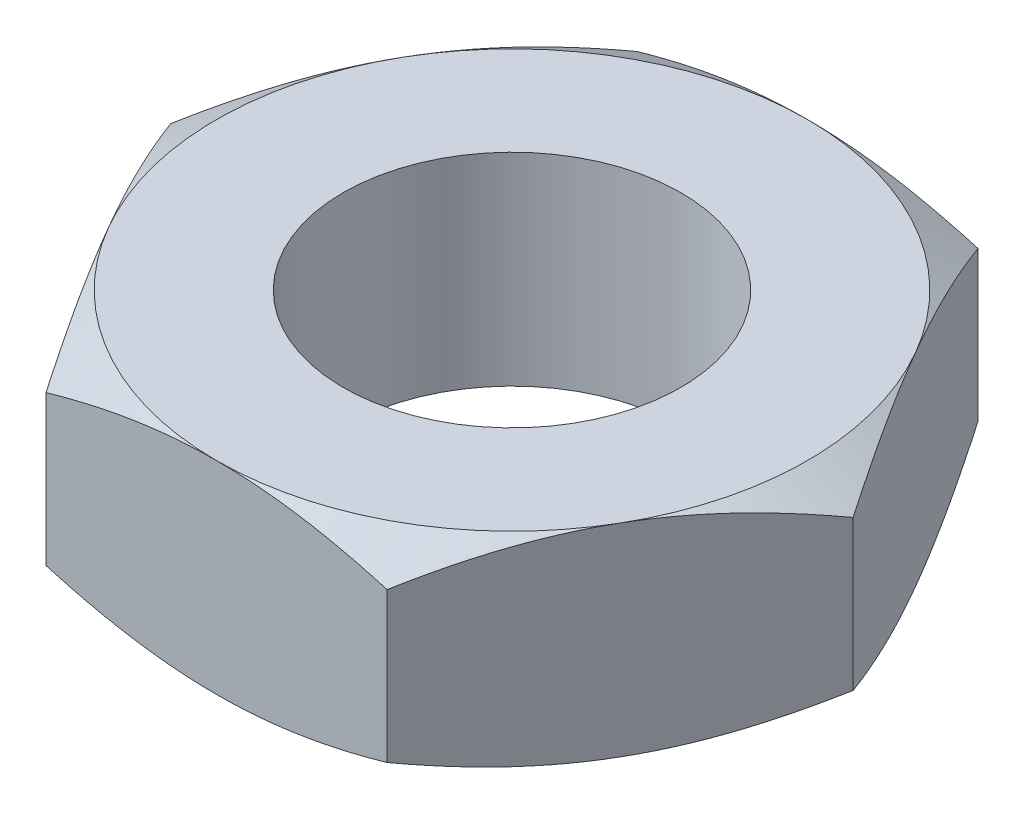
ISO-10303-21;
HEADER;
FILE_DESCRIPTION(('STEP AP214'),'2;1');
FILE_NAME('part.step','',(''),(''),'','','');
FILE_SCHEMA(('AUTOMOTIVE_DESIGN { 1 0 10303 214 1 1 1 1 }'));
ENDSEC;
DATA;
#1=APPLICATION_CONTEXT('core data for automotive mechanical design processes');
#2=APPLICATION_PROTOCOL_DEFINITION('international standard','automotive_design',2000,#1);
#3=PRODUCT_CONTEXT('',#1,'mechanical');
#4=PRODUCT('Part','Part','',(#3));
#5=PRODUCT_RELATED_PRODUCT_CATEGORY('part','',(#4));
#6=PRODUCT_DEFINITION_FORMATION('','',#4);
#7=PRODUCT_DEFINITION_CONTEXT('part definition',#1,'design');
#8=PRODUCT_DEFINITION('design','',#6,#7);
#9=PRODUCT_DEFINITION_SHAPE('','',#8);
#10=(LENGTH_UNIT() NAMED_UNIT(*) SI_UNIT(.MILLI.,.METRE.));
#11=(NAMED_UNIT(*) PLANE_ANGLE_UNIT() SI_UNIT($,.RADIAN.));
#12=(NAMED_UNIT(*) SI_UNIT($,.STERADIAN.) SOLID_ANGLE_UNIT());
#13=UNCERTAINTY_MEASURE_WITH_UNIT(LENGTH_MEASURE(1.E-05),#10,'distance_accuracy_value','');
#14=(GEOMETRIC_REPRESENTATION_CONTEXT(3) GLOBAL_UNCERTAINTY_ASSIGNED_CONTEXT((#13)) GLOBAL_UNIT_ASSIGNED_CONTEXT((#10,
#11,#12)) REPRESENTATION_CONTEXT('',''));
#15=CARTESIAN_POINT('',(0.,0.,0.));
#16=DIRECTION('',(0.,0.,1.));
#17=DIRECTION('',(1.,0.,0.));
#18=AXIS2_PLACEMENT_3D('',#15,#16,#17);
#19=CARTESIAN_POINT('',(-20.,8.4,0.));
#20=DIRECTION('',(0.,1.,0.));
#21=DIRECTION('',(-1.,0.,0.));
#22=AXIS2_PLACEMENT_3D('',#19,#20,#21);
#23=PLANE('',#22);
#24=CARTESIAN_POINT('',(-20.,8.4,0.));
#25=DIRECTION('',(0.,1.,0.));
#26=DIRECTION('',(-1.,0.,0.));
#27=AXIS2_PLACEMENT_3D('',#24,#25,#26);
#28=CIRCLE('',#27,2.);
#29=CARTESIAN_POINT('',(-22.,8.4,0.));
#30=VERTEX_POINT('',#29);
#31=EDGE_CURVE('E274',#30,#30,#28,.T.);
#32=ORIENTED_EDGE('',*,*,#31,.T.);
#33=EDGE_LOOP('',(#32));
#34=FACE_BOUND('',#33,.T.);
#35=CARTESIAN_POINT('',(-20.,8.4,0.));
#36=DIRECTION('',(0.,1.,0.));
#37=DIRECTION('',(-1.,0.,0.));
#38=AXIS2_PLACEMENT_3D('',#35,#36,#37);
#39=CIRCLE('',#38,3.5);
#40=CARTESIAN_POINT('',(-23.0310889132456,8.4,1.75));
#41=VERTEX_POINT('',#40);
#42=CARTESIAN_POINT('',(-23.0310889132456,8.4,-1.75));
#43=VERTEX_POINT('',#42);
#44=EDGE_CURVE('E22',#41,#43,#39,.F.);
#45=ORIENTED_EDGE('',*,*,#44,.T.);
#46=CARTESIAN_POINT('',(-20.,8.4,-3.5));
#47=VERTEX_POINT('',#46);
#48=EDGE_CURVE('E11',#43,#47,#39,.F.);
#49=ORIENTED_EDGE('',*,*,#48,.T.);
#50=CARTESIAN_POINT('',(-16.9689110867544,8.4,-1.75));
#51=VERTEX_POINT('',#50);
#52=EDGE_CURVE('E27',#47,#51,#39,.F.);
#53=ORIENTED_EDGE('',*,*,#52,.T.);
#54=CARTESIAN_POINT('',(-16.9689110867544,8.4,1.75));
#55=VERTEX_POINT('',#54);
#56=EDGE_CURVE('E390',#51,#55,#39,.F.);
#57=ORIENTED_EDGE('',*,*,#56,.T.);
#58=CARTESIAN_POINT('',(-20.,8.4,3.5));
#59=VERTEX_POINT('',#58);
#60=EDGE_CURVE('E127',#55,#59,#39,.F.);
#61=ORIENTED_EDGE('',*,*,#60,.T.);
#62=CARTESIAN_POINT('',(-20.,8.4,0.));
#63=DIRECTION('',(0.,1.,0.));
#64=DIRECTION('',(-1.,0.,0.));
#65=AXIS2_PLACEMENT_3D('',#62,#63,#64);
#66=CIRCLE('',#65,3.5);
#67=EDGE_CURVE('E110',#41,#59,#66,.T.);
#68=ORIENTED_EDGE('',*,*,#67,.F.);
#69=EDGE_LOOP('',(#45,#49,#53,#57,#61,#68));
#70=FACE_BOUND('',#69,.T.);
#71=ADVANCED_FACE('F17',(#34,#70),#23,.F.);
#72=CARTESIAN_POINT('',(-17.9792740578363,8.4,3.5));
#73=DIRECTION('',(0.866025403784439,0.,0.5));
#74=DIRECTION('',(0.5,0.,-0.866025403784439));
#75=AXIS2_PLACEMENT_3D('',#72,#73,#74);
#76=PLANE('',#75);
#77=CARTESIAN_POINT('',(-15.9584326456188,8.71267406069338,-0.00019999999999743));
#78=CARTESIAN_POINT('',(-16.0472332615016,8.66138578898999,0.153607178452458));
#79=CARTESIAN_POINT('',(-16.136800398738,8.6147409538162,0.308742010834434));
#80=CARTESIAN_POINT('',(-16.3174856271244,8.53332187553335,0.621698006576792));
#81=CARTESIAN_POINT('',(-16.4086069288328,8.49857643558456,0.779524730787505));
#82=CARTESIAN_POINT('',(-16.5897202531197,8.44449002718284,1.09322221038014));
#83=CARTESIAN_POINT('',(-16.6796844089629,8.42478908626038,1.2490446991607));
#84=CARTESIAN_POINT('',(-16.8600360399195,8.40127013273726,1.56142288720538));
#85=CARTESIAN_POINT('',(-16.9504228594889,8.39743264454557,1.71797745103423));
#86=CARTESIAN_POINT('',(-17.1193161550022,8.40541530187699,2.01050921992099));
#87=CARTESIAN_POINT('',(-17.1978479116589,8.41527543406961,2.14653021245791));
#88=CARTESIAN_POINT('',(-17.3543997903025,8.4465264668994,2.417686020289));
#89=CARTESIAN_POINT('',(-17.4324193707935,8.4679280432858,2.55281989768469));
#90=CARTESIAN_POINT('',(-17.5892940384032,8.52143040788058,2.82453479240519));
#91=CARTESIAN_POINT('',(-17.6681292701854,8.55375799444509,2.96108141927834));
#92=CARTESIAN_POINT('',(-17.8246239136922,8.62712893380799,3.23213809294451));
#93=CARTESIAN_POINT('',(-17.902285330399,8.66815504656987,3.36665161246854));
#94=CARTESIAN_POINT('',(-17.9793895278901,8.71267406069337,3.5002));
#95=B_SPLINE_CURVE_WITH_KNOTS('',3,(#77,#78,#79,#80,#81,#82,#83,#84,#85,#86,#87,#88,#89,#90,#91,
#92,#93,#94),.UNSPECIFIED.,.F.,.F.,(4,2,2,2,2,2,2,2,4),(0.,0.554793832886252,1.11092123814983,
1.65328467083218,2.19498204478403,2.66665130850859,3.13875761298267,3.62133612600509,
4.10296698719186),.UNSPECIFIED.);
#96=CARTESIAN_POINT('',(-15.9585481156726,8.71260739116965,0.));
#97=VERTEX_POINT('',#96);
#98=EDGE_CURVE('E335',#97,#55,#95,.T.);
#99=ORIENTED_EDGE('',*,*,#98,.F.);
#100=DIRECTION('',(0.,1.,0.));
#101=VECTOR('',#100,1.);
#102=CARTESIAN_POINT('',(-15.9585481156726,8.4,0.));
#103=LINE('',#102,#101);
#104=CARTESIAN_POINT('',(-15.9585481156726,10.4873926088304,0.));
#105=VERTEX_POINT('',#104);
#106=EDGE_CURVE('E285',#97,#105,#103,.T.);
#107=ORIENTED_EDGE('',*,*,#106,.T.);
#108=CARTESIAN_POINT('',(-15.9584326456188,10.4873259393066,-0.000199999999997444));
#109=CARTESIAN_POINT('',(-16.0472332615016,10.53861421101,0.153607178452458));
#110=CARTESIAN_POINT('',(-16.136800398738,10.5852590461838,0.308742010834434));
#111=CARTESIAN_POINT('',(-16.3174856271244,10.6666781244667,0.621698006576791));
#112=CARTESIAN_POINT('',(-16.4086069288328,10.7014235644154,0.779524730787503));
#113=CARTESIAN_POINT('',(-16.5897202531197,10.7555099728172,1.09322221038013));
#114=CARTESIAN_POINT('',(-16.6796844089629,10.7752109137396,1.2490446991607));
#115=CARTESIAN_POINT('',(-16.8600360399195,10.7987298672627,1.56142288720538));
#116=CARTESIAN_POINT('',(-16.9504228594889,10.8025673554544,1.71797745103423));
#117=CARTESIAN_POINT('',(-17.1193161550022,10.794584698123,2.01050921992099));
#118=CARTESIAN_POINT('',(-17.1978479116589,10.7847245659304,2.14653021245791));
#119=CARTESIAN_POINT('',(-17.3543997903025,10.7534735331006,2.417686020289));
#120=CARTESIAN_POINT('',(-17.4324193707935,10.7320719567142,2.55281989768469));
#121=CARTESIAN_POINT('',(-17.5892940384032,10.6785695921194,2.82453479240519));
#122=CARTESIAN_POINT('',(-17.6681292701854,10.6462420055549,2.96108141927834));
#123=CARTESIAN_POINT('',(-17.8246239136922,10.572871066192,3.23213809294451));
#124=CARTESIAN_POINT('',(-17.902285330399,10.5318449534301,3.36665161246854));
#125=CARTESIAN_POINT('',(-17.9793895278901,10.4873259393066,3.5002));
#126=B_SPLINE_CURVE_WITH_KNOTS('',3,(#108,#109,#110,#111,#112,#113,#114,#115,#116,#117,#118,
#119,#120,#121,#122,#123,#124,#125),.UNSPECIFIED.,.F.,.F.,(4,2,2,2,2,2,2,2,4),(0.,
0.554793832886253,1.11092123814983,1.65328467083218,2.19498204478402,2.66665130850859,
3.13875761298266,3.62133612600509,4.10296698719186),.UNSPECIFIED.);
#127=CARTESIAN_POINT('',(-16.9689110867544,10.8,1.75));
#128=VERTEX_POINT('',#127);
#129=EDGE_CURVE('E279',#105,#128,#126,.T.);
#130=ORIENTED_EDGE('',*,*,#129,.T.);
#131=CARTESIAN_POINT('',(-17.9792740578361,10.4873926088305,3.5));
#132=VERTEX_POINT('',#131);
#133=EDGE_CURVE('E241',#128,#132,#126,.T.);
#134=ORIENTED_EDGE('',*,*,#133,.T.);
#135=DIRECTION('',(0.,1.,0.));
#136=VECTOR('',#135,1.);
#137=CARTESIAN_POINT('',(-17.9792740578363,8.4,3.5));
#138=LINE('',#137,#136);
#139=CARTESIAN_POINT('',(-17.9792740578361,8.71260739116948,3.5));
#140=VERTEX_POINT('',#139);
#141=EDGE_CURVE('E289',#140,#132,#138,.T.);
#142=ORIENTED_EDGE('',*,*,#141,.F.);
#143=EDGE_CURVE('E339',#55,#140,#95,.T.);
#144=ORIENTED_EDGE('',*,*,#143,.F.);
#145=EDGE_LOOP('',(#99,#107,#130,#134,#142,#144));
#146=FACE_BOUND('',#145,.T.);
#147=ADVANCED_FACE('F19',(#146),#76,.T.);
#148=CARTESIAN_POINT('',(-22.0207259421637,8.4,3.5));
#149=DIRECTION('',(0.,0.,1.));
#150=DIRECTION('',(1.,0.,0.));
#151=AXIS2_PLACEMENT_3D('',#148,#149,#150);
#152=PLANE('',#151);
#153=CARTESIAN_POINT('',(-14.5166727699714,10.1350197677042,3.5));
#154=CARTESIAN_POINT('',(-14.6700345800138,10.0604044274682,3.5));
#155=CARTESIAN_POINT('',(-14.8237425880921,9.98648875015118,3.5));
#156=CARTESIAN_POINT('',(-15.132034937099,9.84044921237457,3.5));
#157=CARTESIAN_POINT('',(-15.2866194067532,9.76832562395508,3.5));
#158=CARTESIAN_POINT('',(-15.5976185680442,9.62591178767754,3.5));
#159=CARTESIAN_POINT('',(-15.754038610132,9.55563318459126,3.5));
#160=CARTESIAN_POINT('',(-16.0681037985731,9.41787952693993,3.5));
#161=CARTESIAN_POINT('',(-16.2257488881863,9.35040434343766,3.5));
#162=CARTESIAN_POINT('',(-16.5477700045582,9.21681588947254,3.5));
#163=CARTESIAN_POINT('',(-16.7121958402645,9.15082204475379,3.5));
#164=CARTESIAN_POINT('',(-17.0429505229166,9.02369618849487,3.5));
#165=CARTESIAN_POINT('',(-17.2092795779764,8.96256471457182,3.5));
#166=CARTESIAN_POINT('',(-17.5438116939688,8.84672760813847,3.5));
#167=CARTESIAN_POINT('',(-17.7120103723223,8.79200944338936,3.5));
#168=CARTESIAN_POINT('',(-18.0508198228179,8.69071789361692,3.5));
#169=CARTESIAN_POINT('',(-18.2214298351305,8.64414200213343,3.5));
#170=CARTESIAN_POINT('',(-18.5642222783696,8.56157866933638,3.5));
#171=CARTESIAN_POINT('',(-18.7363904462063,8.52553308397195,3.5));
#172=CARTESIAN_POINT('',(-19.0829244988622,8.46603551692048,3.5));
#173=CARTESIAN_POINT('',(-19.2572901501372,8.44258220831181,3.5));
#174=CARTESIAN_POINT('',(-19.6050476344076,8.41044466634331,3.5));
#175=CARTESIAN_POINT('',(-19.7784210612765,8.40156618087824,3.5));
#176=CARTESIAN_POINT('',(-20.1253044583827,8.39881603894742,3.5));
#177=CARTESIAN_POINT('',(-20.2988144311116,8.40494466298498,3.5));
#178=CARTESIAN_POINT('',(-20.5917232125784,8.42751919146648,3.5));
#179=CARTESIAN_POINT('',(-20.7114284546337,8.4402328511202,3.5));
#180=CARTESIAN_POINT('',(-20.9499937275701,8.472041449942,3.5));
#181=CARTESIAN_POINT('',(-21.0688536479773,8.49113720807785,3.5));
#182=CARTESIAN_POINT('',(-21.4239864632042,8.55699713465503,3.5));
#183=CARTESIAN_POINT('',(-21.6586909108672,8.61232331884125,3.5));
#184=CARTESIAN_POINT('',(-22.0097907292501,8.70867398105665,3.5));
#185=CARTESIAN_POINT('',(-22.1279937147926,8.74348999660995,3.5));
#186=CARTESIAN_POINT('',(-22.3632520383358,8.81683863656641,3.5));
#187=CARTESIAN_POINT('',(-22.4803073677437,8.85537128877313,3.5));
#188=CARTESIAN_POINT('',(-22.7133067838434,8.93552644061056,3.5));
#189=CARTESIAN_POINT('',(-22.8292511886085,8.97714802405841,3.5));
#190=CARTESIAN_POINT('',(-23.0601714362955,9.06298125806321,3.5));
#191=CARTESIAN_POINT('',(-23.175147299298,9.10719285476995,3.5));
#192=CARTESIAN_POINT('',(-23.4783539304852,9.22708014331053,3.5));
#193=CARTESIAN_POINT('',(-23.6658522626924,9.30460626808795,3.5));
#194=CARTESIAN_POINT('',(-24.0389767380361,9.4640552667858,3.5));
#195=CARTESIAN_POINT('',(-24.2246026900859,9.54597858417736,3.5));
#196=CARTESIAN_POINT('',(-24.5943936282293,9.71320273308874,3.5));
#197=CARTESIAN_POINT('',(-24.7785581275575,9.79850463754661,3.5));
#198=CARTESIAN_POINT('',(-25.1456645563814,9.97170509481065,3.5));
#199=CARTESIAN_POINT('',(-25.3286064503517,10.0596037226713,3.5));
#200=CARTESIAN_POINT('',(-25.6937641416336,10.2375705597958,3.5));
#201=CARTESIAN_POINT('',(-25.8759784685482,10.3276417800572,3.5));
#202=CARTESIAN_POINT('',(-26.2395914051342,10.5094176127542,3.5));
#203=CARTESIAN_POINT('',(-26.420990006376,10.601122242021,3.5));
#204=CARTESIAN_POINT('',(-26.9641101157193,10.8781586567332,3.5));
#205=CARTESIAN_POINT('',(-27.324831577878,11.0654501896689,3.5));
#206=CARTESIAN_POINT('',(-28.0076611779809,11.4242346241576,3.5));
#207=CARTESIAN_POINT('',(-28.3299492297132,11.5953867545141,3.5));
#208=CARTESIAN_POINT('',(-28.9734274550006,11.9397848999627,3.5));
#209=CARTESIAN_POINT('',(-29.2946175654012,12.1130310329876,3.5));
#210=CARTESIAN_POINT('',(-29.9351285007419,12.4605235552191,3.5));
#211=CARTESIAN_POINT('',(-30.2544520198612,12.6347649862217,3.5));
#212=CARTESIAN_POINT('',(-30.8924123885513,12.9844450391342,3.5));
#213=CARTESIAN_POINT('',(-31.2110492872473,13.1598835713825,3.5));
#214=CARTESIAN_POINT('',(-31.5294431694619,13.3357592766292,3.5));
#215=B_SPLINE_CURVE_WITH_KNOTS('',3,(#153,#154,#155,#156,#157,#158,#159,#160,#161,#162,#163,
#164,#165,#166,#167,#168,#169,#170,#171,#172,#173,#174,#175,#176,#177,#178,#179,#180,#181,#182,
#183,#184,#185,#186,#187,#188,#189,#190,#191,#192,#193,#194,#195,#196,#197,#198,#199,#200,#201,
#202,#203,#204,#205,#206,#207,#208,#209,#210,#211,#212,#213,#214),.UNSPECIFIED.,.F.,.F.,(4,2,2,
2,2,2,2,2,2,2,2,2,2,2,2,2,2,2,2,2,2,2,2,2,2,2,2,2,2,2,4),(0.,0.511655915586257,1.02338903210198,
1.53781503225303,2.05221734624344,2.58368340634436,3.11520814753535,3.64567628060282,
4.17598082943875,4.70329937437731,5.23056234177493,5.75073918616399,6.27092575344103,
6.63188726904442,6.99289512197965,7.71527505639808,8.08491355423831,8.45455481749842,
8.82408687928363,9.19361126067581,9.80221022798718,10.4108706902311,11.0197260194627,
11.6285989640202,12.2383706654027,12.8481486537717,14.0674517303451,15.1621875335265,
16.2569852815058,17.3482883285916,18.4395105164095),.UNSPECIFIED.);
#216=EDGE_CURVE('E345',#140,#59,#215,.T.);
#217=ORIENTED_EDGE('',*,*,#216,.F.);
#218=ORIENTED_EDGE('',*,*,#141,.T.);
#219=CARTESIAN_POINT('',(-14.5166727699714,9.06498023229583,3.5));
#220=CARTESIAN_POINT('',(-14.6700345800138,9.13959557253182,3.5));
#221=CARTESIAN_POINT('',(-14.8237425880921,9.21351124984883,3.5));
#222=CARTESIAN_POINT('',(-15.132034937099,9.35955078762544,3.5));
#223=CARTESIAN_POINT('',(-15.2866194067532,9.43167437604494,3.5));
#224=CARTESIAN_POINT('',(-15.5976185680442,9.57408821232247,3.5));
#225=CARTESIAN_POINT('',(-15.754038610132,9.64436681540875,3.5));
#226=CARTESIAN_POINT('',(-16.0681037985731,9.78212047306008,3.5));
#227=CARTESIAN_POINT('',(-16.2257488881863,9.84959565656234,3.5));
#228=CARTESIAN_POINT('',(-16.5477700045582,9.98318411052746,3.5));
#229=CARTESIAN_POINT('',(-16.7121958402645,10.0491779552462,3.5));
#230=CARTESIAN_POINT('',(-17.0429505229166,10.1763038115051,3.5));
#231=CARTESIAN_POINT('',(-17.2092795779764,10.2374352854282,3.5));
#232=CARTESIAN_POINT('',(-17.5438116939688,10.3532723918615,3.5));
#233=CARTESIAN_POINT('',(-17.7120103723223,10.4079905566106,3.5));
#234=CARTESIAN_POINT('',(-18.0508198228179,10.5092821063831,3.5));
#235=CARTESIAN_POINT('',(-18.2214298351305,10.5558579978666,3.5));
#236=CARTESIAN_POINT('',(-18.5642222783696,10.6384213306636,3.5));
#237=CARTESIAN_POINT('',(-18.7363904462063,10.674466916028,3.5));
#238=CARTESIAN_POINT('',(-19.0829244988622,10.7339644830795,3.5));
#239=CARTESIAN_POINT('',(-19.2572901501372,10.7574177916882,3.5));
#240=CARTESIAN_POINT('',(-19.6050476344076,10.7895553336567,3.5));
#241=CARTESIAN_POINT('',(-19.7784210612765,10.7984338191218,3.5));
#242=CARTESIAN_POINT('',(-20.1253044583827,10.8011839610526,3.5));
#243=CARTESIAN_POINT('',(-20.2988144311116,10.795055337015,3.5));
#244=CARTESIAN_POINT('',(-20.5917232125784,10.7724808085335,3.5));
#245=CARTESIAN_POINT('',(-20.7114284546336,10.7597671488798,3.5));
#246=CARTESIAN_POINT('',(-20.9499937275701,10.727958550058,3.5));
#247=CARTESIAN_POINT('',(-21.0688536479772,10.7088627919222,3.5));
#248=CARTESIAN_POINT('',(-21.4239864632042,10.643002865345,3.5));
#249=CARTESIAN_POINT('',(-21.6586909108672,10.5876766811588,3.5));
#250=CARTESIAN_POINT('',(-22.0097907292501,10.4913260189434,3.5));
#251=CARTESIAN_POINT('',(-22.1279937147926,10.45651000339,3.5));
#252=CARTESIAN_POINT('',(-22.3632520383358,10.3831613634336,3.5));
#253=CARTESIAN_POINT('',(-22.4803073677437,10.3446287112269,3.5));
#254=CARTESIAN_POINT('',(-22.7133067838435,10.2644735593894,3.5));
#255=CARTESIAN_POINT('',(-22.8292511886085,10.2228519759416,3.5));
#256=CARTESIAN_POINT('',(-23.0601714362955,10.1370187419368,3.5));
#257=CARTESIAN_POINT('',(-23.1751472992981,10.09280714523,3.5));
#258=CARTESIAN_POINT('',(-23.4783539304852,9.97291985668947,3.5));
#259=CARTESIAN_POINT('',(-23.6658522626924,9.89539373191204,3.5));
#260=CARTESIAN_POINT('',(-24.0389767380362,9.73594473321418,3.5));
#261=CARTESIAN_POINT('',(-24.224602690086,9.65402141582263,3.5));
#262=CARTESIAN_POINT('',(-24.5943936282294,9.48679726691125,3.5));
#263=CARTESIAN_POINT('',(-24.7785581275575,9.40149536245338,3.5));
#264=CARTESIAN_POINT('',(-25.1456645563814,9.22829490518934,3.5));
#265=CARTESIAN_POINT('',(-25.3286064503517,9.14039627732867,3.5));
#266=CARTESIAN_POINT('',(-25.6937641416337,8.96242944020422,3.5));
#267=CARTESIAN_POINT('',(-25.8759784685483,8.87235821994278,3.5));
#268=CARTESIAN_POINT('',(-26.2395914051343,8.69058238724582,3.5));
#269=CARTESIAN_POINT('',(-26.420990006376,8.59887775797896,3.5));
#270=CARTESIAN_POINT('',(-26.9641101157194,8.32184134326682,3.5));
#271=CARTESIAN_POINT('',(-27.324831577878,8.13454981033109,3.5));
#272=CARTESIAN_POINT('',(-28.007661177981,7.77576537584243,3.5));
#273=CARTESIAN_POINT('',(-28.3299492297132,7.60461324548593,3.5));
#274=CARTESIAN_POINT('',(-28.9734274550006,7.26021510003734,3.5));
#275=CARTESIAN_POINT('',(-29.2946175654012,7.08696896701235,3.5));
#276=CARTESIAN_POINT('',(-29.9351285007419,6.73947644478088,3.5));
#277=CARTESIAN_POINT('',(-30.2544520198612,6.56523501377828,3.5));
#278=CARTESIAN_POINT('',(-30.8924123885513,6.21555496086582,3.5));
#279=CARTESIAN_POINT('',(-31.2110492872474,6.04011642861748,3.5));
#280=CARTESIAN_POINT('',(-31.5294431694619,5.86424072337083,3.5));
#281=B_SPLINE_CURVE_WITH_KNOTS('',3,(#219,#220,#221,#222,#223,#224,#225,#226,#227,#228,#229,
#230,#231,#232,#233,#234,#235,#236,#237,#238,#239,#240,#241,#242,#243,#244,#245,#246,#247,#248,
#249,#250,#251,#252,#253,#254,#255,#256,#257,#258,#259,#260,#261,#262,#263,#264,#265,#266,#267,
#268,#269,#270,#271,#272,#273,#274,#275,#276,#277,#278,#279,#280),.UNSPECIFIED.,.F.,.F.,(4,2,2,
2,2,2,2,2,2,2,2,2,2,2,2,2,2,2,2,2,2,2,2,2,2,2,2,2,2,2,4),(0.,0.511655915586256,1.02338903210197,
1.53781503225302,2.05221734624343,2.58368340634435,3.11520814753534,3.64567628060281,
4.17598082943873,4.70329937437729,5.23056234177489,5.75073918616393,6.27092575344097,
6.63188726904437,6.99289512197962,7.71527505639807,8.08491355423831,8.45455481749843,
8.82408687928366,9.19361126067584,9.80221022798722,10.4108706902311,11.0197260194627,
11.6285989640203,12.2383706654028,12.8481486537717,14.0674517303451,15.1621875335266,
16.2569852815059,17.3482883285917,18.4395105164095),.UNSPECIFIED.);
#282=CARTESIAN_POINT('',(-20.,10.8,3.5));
#283=VERTEX_POINT('',#282);
#284=EDGE_CURVE('E240',#132,#283,#281,.T.);
#285=ORIENTED_EDGE('',*,*,#284,.T.);
#286=CARTESIAN_POINT('',(-22.0207259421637,10.4873926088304,3.5));
#287=VERTEX_POINT('',#286);
#288=EDGE_CURVE('E232',#283,#287,#281,.T.);
#289=ORIENTED_EDGE('',*,*,#288,.T.);
#290=DIRECTION('',(0.,1.,0.));
#291=VECTOR('',#290,1.);
#292=CARTESIAN_POINT('',(-22.0207259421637,8.4,3.5));
#293=LINE('',#292,#291);
#294=CARTESIAN_POINT('',(-22.0207259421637,8.71260739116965,3.5));
#295=VERTEX_POINT('',#294);
#296=EDGE_CURVE('E293',#295,#287,#293,.T.);
#297=ORIENTED_EDGE('',*,*,#296,.F.);
#298=EDGE_CURVE('E113',#59,#295,#215,.T.);
#299=ORIENTED_EDGE('',*,*,#298,.F.);
#300=EDGE_LOOP('',(#217,#218,#285,#289,#297,#299));
#301=FACE_BOUND('',#300,.T.);
#302=ADVANCED_FACE('F247',(#301),#152,.T.);
#303=CARTESIAN_POINT('',(-24.0414518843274,8.4,0.));
#304=DIRECTION('',(-0.866025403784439,0.,0.5));
#305=DIRECTION('',(0.5,0.,0.866025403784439));
#306=AXIS2_PLACEMENT_3D('',#303,#304,#305);
#307=PLANE('',#306);
#308=CARTESIAN_POINT('',(-22.0206104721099,8.71267406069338,3.5002));
#309=CARTESIAN_POINT('',(-22.1094110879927,8.66138578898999,3.34639282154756));
#310=CARTESIAN_POINT('',(-22.1989782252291,8.61474095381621,3.19125798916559));
#311=CARTESIAN_POINT('',(-22.3796634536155,8.53332187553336,2.87830199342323));
#312=CARTESIAN_POINT('',(-22.4707847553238,8.49857643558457,2.72047526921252));
#313=CARTESIAN_POINT('',(-22.6518980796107,8.44449002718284,2.40677778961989));
#314=CARTESIAN_POINT('',(-22.741862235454,8.42478908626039,2.25095530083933));
#315=CARTESIAN_POINT('',(-22.9222138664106,8.40127013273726,1.93857711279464));
#316=CARTESIAN_POINT('',(-23.01260068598,8.39743264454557,1.78202254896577));
#317=CARTESIAN_POINT('',(-23.1814939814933,8.40541530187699,1.48949078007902));
#318=CARTESIAN_POINT('',(-23.2600257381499,8.41527543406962,1.35346978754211));
#319=CARTESIAN_POINT('',(-23.4165776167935,8.44652646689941,1.08231397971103));
#320=CARTESIAN_POINT('',(-23.4945971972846,8.46792804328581,0.947180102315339));
#321=CARTESIAN_POINT('',(-23.6514718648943,8.52143040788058,0.675465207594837));
#322=CARTESIAN_POINT('',(-23.7303070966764,8.55375799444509,0.538918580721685));
#323=CARTESIAN_POINT('',(-23.8868017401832,8.627128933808,0.267861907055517));
#324=CARTESIAN_POINT('',(-23.9644631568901,8.66815504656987,0.133348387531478));
#325=CARTESIAN_POINT('',(-24.0415673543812,8.71267406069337,-0.000199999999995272));
#326=B_SPLINE_CURVE_WITH_KNOTS('',3,(#308,#309,#310,#311,#312,#313,#314,#315,#316,#317,#318,
#319,#320,#321,#322,#323,#324,#325),.UNSPECIFIED.,.F.,.F.,(4,2,2,2,2,2,2,2,4),(0.,
0.55479383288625,1.11092123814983,1.65328467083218,2.19498204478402,2.66665130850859,
3.13875761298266,3.62133612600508,4.10296698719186),.UNSPECIFIED.);
#327=EDGE_CURVE('E106',#295,#41,#326,.T.);
#328=ORIENTED_EDGE('',*,*,#327,.F.);
#329=ORIENTED_EDGE('',*,*,#296,.T.);
#330=CARTESIAN_POINT('',(-22.0206104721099,10.4873259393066,3.5002));
#331=CARTESIAN_POINT('',(-22.1094110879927,10.53861421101,3.34639282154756));
#332=CARTESIAN_POINT('',(-22.1989782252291,10.5852590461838,3.19125798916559));
#333=CARTESIAN_POINT('',(-22.3796634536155,10.6666781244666,2.87830199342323));
#334=CARTESIAN_POINT('',(-22.4707847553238,10.7014235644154,2.72047526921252));
#335=CARTESIAN_POINT('',(-22.6518980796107,10.7555099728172,2.40677778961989));
#336=CARTESIAN_POINT('',(-22.741862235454,10.7752109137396,2.25095530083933));
#337=CARTESIAN_POINT('',(-22.9222138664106,10.7987298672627,1.93857711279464));
#338=CARTESIAN_POINT('',(-23.01260068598,10.8025673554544,1.78202254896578));
#339=CARTESIAN_POINT('',(-23.1814939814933,10.794584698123,1.48949078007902));
#340=CARTESIAN_POINT('',(-23.2600257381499,10.7847245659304,1.35346978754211));
#341=CARTESIAN_POINT('',(-23.4165776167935,10.7534735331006,1.08231397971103));
#342=CARTESIAN_POINT('',(-23.4945971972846,10.7320719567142,0.94718010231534));
#343=CARTESIAN_POINT('',(-23.6514718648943,10.6785695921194,0.675465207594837));
#344=CARTESIAN_POINT('',(-23.7303070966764,10.6462420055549,0.538918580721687));
#345=CARTESIAN_POINT('',(-23.8868017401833,10.572871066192,0.267861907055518));
#346=CARTESIAN_POINT('',(-23.9644631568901,10.5318449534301,0.133348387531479));
#347=CARTESIAN_POINT('',(-24.0415673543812,10.4873259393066,-0.000199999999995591));
#348=B_SPLINE_CURVE_WITH_KNOTS('',3,(#330,#331,#332,#333,#334,#335,#336,#337,#338,#339,#340,
#341,#342,#343,#344,#345,#346,#347),.UNSPECIFIED.,.F.,.F.,(4,2,2,2,2,2,2,2,4),(0.,
0.554793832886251,1.11092123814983,1.65328467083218,2.19498204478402,2.66665130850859,
3.13875761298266,3.62133612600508,4.10296698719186),.UNSPECIFIED.);
#349=CARTESIAN_POINT('',(-23.0310889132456,10.8,1.75));
#350=VERTEX_POINT('',#349);
#351=EDGE_CURVE('E231',#287,#350,#348,.T.);
#352=ORIENTED_EDGE('',*,*,#351,.T.);
#353=CARTESIAN_POINT('',(-24.0414518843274,10.4873926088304,0.));
#354=VERTEX_POINT('',#353);
#355=EDGE_CURVE('E225',#350,#354,#348,.T.);
#356=ORIENTED_EDGE('',*,*,#355,.T.);
#357=DIRECTION('',(0.,1.,0.));
#358=VECTOR('',#357,1.);
#359=CARTESIAN_POINT('',(-24.0414518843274,8.4,0.));
#360=LINE('',#359,#358);
#361=CARTESIAN_POINT('',(-24.0414518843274,8.71260739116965,0.));
#362=VERTEX_POINT('',#361);
#363=EDGE_CURVE('E136',#362,#354,#360,.T.);
#364=ORIENTED_EDGE('',*,*,#363,.F.);
#365=EDGE_CURVE('E118',#41,#362,#326,.T.);
#366=ORIENTED_EDGE('',*,*,#365,.F.);
#367=EDGE_LOOP('',(#328,#329,#352,#356,#364,#366));
#368=FACE_BOUND('',#367,.T.);
#369=ADVANCED_FACE('F134',(#368),#307,.T.);
#370=CARTESIAN_POINT('',(-22.0207259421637,8.4,-3.5));
#371=DIRECTION('',(-0.866025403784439,0.,-0.5));
#372=DIRECTION('',(-0.5,0.,0.866025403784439));
#373=AXIS2_PLACEMENT_3D('',#370,#371,#372);
#374=PLANE('',#373);
#375=CARTESIAN_POINT('',(-24.0415673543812,8.71267406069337,0.000200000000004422));
#376=CARTESIAN_POINT('',(-23.9527667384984,8.66138578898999,-0.153607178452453));
#377=CARTESIAN_POINT('',(-23.863199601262,8.6147409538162,-0.30874201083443));
#378=CARTESIAN_POINT('',(-23.6825143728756,8.53332187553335,-0.621698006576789));
#379=CARTESIAN_POINT('',(-23.5913930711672,8.49857643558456,-0.779524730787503));
#380=CARTESIAN_POINT('',(-23.4102797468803,8.44449002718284,-1.09322221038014));
#381=CARTESIAN_POINT('',(-23.3203155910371,8.42478908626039,-1.2490446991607));
#382=CARTESIAN_POINT('',(-23.1399639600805,8.40127013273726,-1.56142288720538));
#383=CARTESIAN_POINT('',(-23.049577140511,8.39743264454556,-1.71797745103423));
#384=CARTESIAN_POINT('',(-22.8806838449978,8.40541530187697,-2.01050921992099));
#385=CARTESIAN_POINT('',(-22.8021520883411,8.41527543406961,-2.14653021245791));
#386=CARTESIAN_POINT('',(-22.6456002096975,8.44652646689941,-2.417686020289));
#387=CARTESIAN_POINT('',(-22.5675806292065,8.4679280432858,-2.55281989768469));
#388=CARTESIAN_POINT('',(-22.4107059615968,8.52143040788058,-2.82453479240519));
#389=CARTESIAN_POINT('',(-22.3318707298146,8.55375799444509,-2.96108141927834));
#390=CARTESIAN_POINT('',(-22.1753760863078,8.627128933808,-3.23213809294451));
#391=CARTESIAN_POINT('',(-22.097714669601,8.66815504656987,-3.36665161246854));
#392=CARTESIAN_POINT('',(-22.0206104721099,8.71267406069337,-3.5002));
#393=B_SPLINE_CURVE_WITH_KNOTS('',3,(#375,#376,#377,#378,#379,#380,#381,#382,#383,#384,#385,
#386,#387,#388,#389,#390,#391,#392),.UNSPECIFIED.,.F.,.F.,(4,2,2,2,2,2,2,2,4),(0.,
0.554793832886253,1.11092123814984,1.65328467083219,2.19498204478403,2.6666513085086,
3.13875761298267,3.62133612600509,4.10296698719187),.UNSPECIFIED.);
#394=EDGE_CURVE('E124',#362,#43,#393,.T.);
#395=ORIENTED_EDGE('',*,*,#394,.F.);
#396=ORIENTED_EDGE('',*,*,#363,.T.);
#397=CARTESIAN_POINT('',(-24.0415673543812,10.4873259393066,0.000200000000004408));
#398=CARTESIAN_POINT('',(-23.9527667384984,10.53861421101,-0.153607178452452));
#399=CARTESIAN_POINT('',(-23.863199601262,10.5852590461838,-0.30874201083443));
#400=CARTESIAN_POINT('',(-23.6825143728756,10.6666781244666,-0.621698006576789));
#401=CARTESIAN_POINT('',(-23.5913930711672,10.7014235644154,-0.779524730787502));
#402=CARTESIAN_POINT('',(-23.4102797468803,10.7555099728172,-1.09322221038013));
#403=CARTESIAN_POINT('',(-23.3203155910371,10.7752109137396,-1.2490446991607));
#404=CARTESIAN_POINT('',(-23.1399639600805,10.7987298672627,-1.56142288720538));
#405=CARTESIAN_POINT('',(-23.0495771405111,10.8025673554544,-1.71797745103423));
#406=CARTESIAN_POINT('',(-22.8806838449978,10.794584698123,-2.01050921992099));
#407=CARTESIAN_POINT('',(-22.8021520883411,10.7847245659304,-2.14653021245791));
#408=CARTESIAN_POINT('',(-22.6456002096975,10.7534735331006,-2.417686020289));
#409=CARTESIAN_POINT('',(-22.5675806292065,10.7320719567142,-2.55281989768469));
#410=CARTESIAN_POINT('',(-22.4107059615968,10.6785695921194,-2.82453479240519));
#411=CARTESIAN_POINT('',(-22.3318707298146,10.6462420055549,-2.96108141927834));
#412=CARTESIAN_POINT('',(-22.1753760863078,10.572871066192,-3.23213809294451));
#413=CARTESIAN_POINT('',(-22.097714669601,10.5318449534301,-3.36665161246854));
#414=CARTESIAN_POINT('',(-22.0206104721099,10.4873259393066,-3.5002));
#415=B_SPLINE_CURVE_WITH_KNOTS('',3,(#397,#398,#399,#400,#401,#402,#403,#404,#405,#406,#407,
#408,#409,#410,#411,#412,#413,#414),.UNSPECIFIED.,.F.,.F.,(4,2,2,2,2,2,2,2,4),(0.,
0.554793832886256,1.11092123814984,1.65328467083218,2.19498204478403,2.6666513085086,
3.13875761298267,3.62133612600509,4.10296698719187),.UNSPECIFIED.);
#416=CARTESIAN_POINT('',(-23.0310889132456,10.8,-1.75));
#417=VERTEX_POINT('',#416);
#418=EDGE_CURVE('E224',#354,#417,#415,.T.);
#419=ORIENTED_EDGE('',*,*,#418,.T.);
#420=CARTESIAN_POINT('',(-22.0207259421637,10.4873926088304,-3.5));
#421=VERTEX_POINT('',#420);
#422=EDGE_CURVE('E217',#417,#421,#415,.T.);
#423=ORIENTED_EDGE('',*,*,#422,.T.);
#424=DIRECTION('',(0.,1.,0.));
#425=VECTOR('',#424,1.);
#426=CARTESIAN_POINT('',(-22.0207259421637,8.4,-3.5));
#427=LINE('',#426,#425);
#428=CARTESIAN_POINT('',(-22.0207259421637,8.71260739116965,-3.5));
#429=VERTEX_POINT('',#428);
#430=EDGE_CURVE('E297',#429,#421,#427,.T.);
#431=ORIENTED_EDGE('',*,*,#430,.F.);
#432=EDGE_CURVE('E141',#43,#429,#393,.T.);
#433=ORIENTED_EDGE('',*,*,#432,.F.);
#434=EDGE_LOOP('',(#395,#396,#419,#423,#431,#433));
#435=FACE_BOUND('',#434,.T.);
#436=ADVANCED_FACE('F195',(#435),#374,.T.);
#437=CARTESIAN_POINT('',(-17.9792740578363,8.4,-3.5));
#438=DIRECTION('',(0.,0.,-1.));
#439=DIRECTION('',(-1.,0.,0.));
#440=AXIS2_PLACEMENT_3D('',#437,#438,#439);
#441=PLANE('',#440);
#442=CARTESIAN_POINT('',(-14.5166727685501,10.1350197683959,-3.5));
#443=CARTESIAN_POINT('',(-14.6700345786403,10.060404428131,-3.5));
#444=CARTESIAN_POINT('',(-14.8237425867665,9.98648875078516,-3.5));
#445=CARTESIAN_POINT('',(-15.1320349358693,9.84044921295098,-3.5));
#446=CARTESIAN_POINT('',(-15.2866194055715,9.76832562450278,-3.5));
#447=CARTESIAN_POINT('',(-15.5976185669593,9.6259117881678,-3.5));
#448=CARTESIAN_POINT('',(-15.7540386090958,9.55563318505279,-3.5));
#449=CARTESIAN_POINT('',(-16.0681037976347,9.41787952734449,-3.5));
#450=CARTESIAN_POINT('',(-16.225748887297,9.35040434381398,-3.5));
#451=CARTESIAN_POINT('',(-16.5477700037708,9.21681588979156,-3.5));
#452=CARTESIAN_POINT('',(-16.71219583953,9.15082204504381,-3.5));
#453=CARTESIAN_POINT('',(-17.0429505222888,9.02369618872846,-3.5));
#454=CARTESIAN_POINT('',(-17.2092795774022,8.96256471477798,-3.5));
#455=CARTESIAN_POINT('',(-17.5438116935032,8.84672760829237,-3.5));
#456=CARTESIAN_POINT('',(-17.7120103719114,8.79200944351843,-3.5));
#457=CARTESIAN_POINT('',(-18.050819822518,8.69071789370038,-3.5));
#458=CARTESIAN_POINT('',(-18.2214298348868,8.6441420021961,-3.5));
#459=CARTESIAN_POINT('',(-18.5642222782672,8.5615786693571,-3.5));
#460=CARTESIAN_POINT('',(-18.7363904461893,8.52553308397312,-3.5));
#461=CARTESIAN_POINT('',(-19.0829244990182,8.46603551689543,-3.5));
#462=CARTESIAN_POINT('',(-19.2572901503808,8.44258220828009,-3.5));
#463=CARTESIAN_POINT('',(-19.6050476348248,8.41044466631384,-3.5));
#464=CARTESIAN_POINT('',(-19.7784210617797,8.40156618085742,-3.5));
#465=CARTESIAN_POINT('',(-20.1253044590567,8.39881603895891,-3.5));
#466=CARTESIAN_POINT('',(-20.2988144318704,8.40494466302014,-3.5));
#467=CARTESIAN_POINT('',(-20.5917232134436,8.42751919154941,-3.5));
#468=CARTESIAN_POINT('',(-20.7114284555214,8.44023285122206,-3.5));
#469=CARTESIAN_POINT('',(-20.9499937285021,8.47204145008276,-3.5));
#470=CARTESIAN_POINT('',(-21.0688536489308,8.49113720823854,-3.5));
#471=CARTESIAN_POINT('',(-21.4239864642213,8.55699713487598,-3.5));
#472=CARTESIAN_POINT('',(-21.6586909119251,8.6123233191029,-3.5));
#473=CARTESIAN_POINT('',(-22.0097907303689,8.70867398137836,-3.5));
#474=CARTESIAN_POINT('',(-22.1279937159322,8.74348999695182,-3.5));
#475=CARTESIAN_POINT('',(-22.3632520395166,8.81683863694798,-3.5));
#476=CARTESIAN_POINT('',(-22.480307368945,8.85537128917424,-3.5));
#477=CARTESIAN_POINT('',(-22.7133067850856,8.93552644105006,-3.5));
#478=CARTESIAN_POINT('',(-22.8292511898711,8.97714802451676,-3.5));
#479=CARTESIAN_POINT('',(-23.0601714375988,9.06298125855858,-3.5));
#480=CARTESIAN_POINT('',(-23.1751473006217,9.10719285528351,-3.5));
#481=CARTESIAN_POINT('',(-23.4783539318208,9.22708014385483,-3.5));
#482=CARTESIAN_POINT('',(-23.6658522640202,9.304606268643,-3.5));
#483=CARTESIAN_POINT('',(-24.0389767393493,9.4640552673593,-3.5));
#484=CARTESIAN_POINT('',(-24.2246026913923,9.54597858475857,-3.5));
#485=CARTESIAN_POINT('',(-24.5943936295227,9.71320273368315,-3.5));
#486=CARTESIAN_POINT('',(-24.7785581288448,9.79850463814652,-3.5));
#487=CARTESIAN_POINT('',(-25.1456645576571,9.97170509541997,-3.5));
#488=CARTESIAN_POINT('',(-25.328606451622,10.0596037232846,-3.5));
#489=CARTESIAN_POINT('',(-25.6937641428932,10.2375705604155,-3.5));
#490=CARTESIAN_POINT('',(-25.8759784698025,10.3276417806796,-3.5));
#491=CARTESIAN_POINT('',(-26.2395914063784,10.5094176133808,-3.5));
#492=CARTESIAN_POINT('',(-26.4209900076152,10.6011222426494,-3.5));
#493=CARTESIAN_POINT('',(-26.9641101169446,10.8781586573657,-3.5));
#494=CARTESIAN_POINT('',(-27.3248315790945,11.065450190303,-3.5));
#495=CARTESIAN_POINT('',(-28.0076611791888,11.4242346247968,-3.5));
#496=CARTESIAN_POINT('',(-28.3299492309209,11.5953867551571,-3.5));
#497=CARTESIAN_POINT('',(-28.9734274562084,11.9397849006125,-3.5));
#498=CARTESIAN_POINT('',(-29.2946175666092,12.1130310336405,-3.5));
#499=CARTESIAN_POINT('',(-29.9351285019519,12.4605235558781,-3.5));
#500=CARTESIAN_POINT('',(-30.2544520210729,12.6347649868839,-3.5));
#501=CARTESIAN_POINT('',(-30.8924123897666,12.9844450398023,-3.5));
#502=CARTESIAN_POINT('',(-31.2110492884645,13.1598835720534,-3.5));
#503=CARTESIAN_POINT('',(-31.5294431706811,13.3357592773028,-3.5));
#504=B_SPLINE_CURVE_WITH_KNOTS('',3,(#442,#443,#444,#445,#446,#447,#448,#449,#450,#451,#452,
#453,#454,#455,#456,#457,#458,#459,#460,#461,#462,#463,#464,#465,#466,#467,#468,#469,#470,#471,
#472,#473,#474,#475,#476,#477,#478,#479,#480,#481,#482,#483,#484,#485,#486,#487,#488,#489,#490,
#491,#492,#493,#494,#495,#496,#497,#498,#499,#500,#501,#502,#503),.UNSPECIFIED.,.F.,.F.,(4,2,2,
2,2,2,2,2,2,2,2,2,2,2,2,2,2,2,2,2,2,2,2,2,2,2,2,2,2,2,4),(0.,0.511655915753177,1.02338903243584,
1.5378150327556,2.05221734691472,2.58368340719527,3.11520814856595,3.64567628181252,
4.17598083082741,4.70329937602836,5.23056234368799,5.75073918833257,6.27092575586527,
6.63188727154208,6.99289512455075,7.71527505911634,8.08491355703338,8.45455482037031,
8.82408688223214,9.19361126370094,9.80221023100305,10.4108706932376,11.0197260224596,
11.6285989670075,12.2383706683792,12.8481486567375,14.0674517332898,15.1621875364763,
16.2569852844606,17.3482883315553,18.4395105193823),.UNSPECIFIED.);
#505=EDGE_CURVE('E189',#429,#47,#504,.F.);
#506=ORIENTED_EDGE('',*,*,#505,.F.);
#507=ORIENTED_EDGE('',*,*,#430,.T.);
#508=CARTESIAN_POINT('',(-14.5166727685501,9.06498023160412,-3.5));
#509=CARTESIAN_POINT('',(-14.6700345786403,9.13959557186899,-3.5));
#510=CARTESIAN_POINT('',(-14.8237425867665,9.21351124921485,-3.5));
#511=CARTESIAN_POINT('',(-15.1320349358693,9.35955078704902,-3.5));
#512=CARTESIAN_POINT('',(-15.2866194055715,9.43167437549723,-3.5));
#513=CARTESIAN_POINT('',(-15.5976185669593,9.57408821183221,-3.5));
#514=CARTESIAN_POINT('',(-15.7540386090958,9.64436681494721,-3.5));
#515=CARTESIAN_POINT('',(-16.0681037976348,9.78212047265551,-3.5));
#516=CARTESIAN_POINT('',(-16.225748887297,9.84959565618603,-3.5));
#517=CARTESIAN_POINT('',(-16.5477700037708,9.98318411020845,-3.5));
#518=CARTESIAN_POINT('',(-16.71219583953,10.0491779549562,-3.5));
#519=CARTESIAN_POINT('',(-17.0429505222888,10.1763038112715,-3.5));
#520=CARTESIAN_POINT('',(-17.2092795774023,10.237435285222,-3.5));
#521=CARTESIAN_POINT('',(-17.5438116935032,10.3532723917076,-3.5));
#522=CARTESIAN_POINT('',(-17.7120103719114,10.4079905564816,-3.5));
#523=CARTESIAN_POINT('',(-18.050819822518,10.5092821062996,-3.5));
#524=CARTESIAN_POINT('',(-18.2214298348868,10.5558579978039,-3.5));
#525=CARTESIAN_POINT('',(-18.5642222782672,10.6384213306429,-3.5));
#526=CARTESIAN_POINT('',(-18.7363904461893,10.6744669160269,-3.5));
#527=CARTESIAN_POINT('',(-19.0829244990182,10.7339644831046,-3.5));
#528=CARTESIAN_POINT('',(-19.2572901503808,10.7574177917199,-3.5));
#529=CARTESIAN_POINT('',(-19.6050476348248,10.7895553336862,-3.5));
#530=CARTESIAN_POINT('',(-19.7784210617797,10.7984338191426,-3.5));
#531=CARTESIAN_POINT('',(-20.1253044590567,10.8011839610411,-3.5));
#532=CARTESIAN_POINT('',(-20.2988144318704,10.7950553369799,-3.5));
#533=CARTESIAN_POINT('',(-20.5917232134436,10.7724808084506,-3.5));
#534=CARTESIAN_POINT('',(-20.7114284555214,10.7597671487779,-3.5));
#535=CARTESIAN_POINT('',(-20.9499937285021,10.7279585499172,-3.5));
#536=CARTESIAN_POINT('',(-21.0688536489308,10.7088627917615,-3.5));
#537=CARTESIAN_POINT('',(-21.4239864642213,10.643002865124,-3.5));
#538=CARTESIAN_POINT('',(-21.6586909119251,10.5876766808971,-3.5));
#539=CARTESIAN_POINT('',(-22.009790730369,10.4913260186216,-3.5));
#540=CARTESIAN_POINT('',(-22.1279937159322,10.4565100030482,-3.5));
#541=CARTESIAN_POINT('',(-22.3632520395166,10.383161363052,-3.5));
#542=CARTESIAN_POINT('',(-22.4803073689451,10.3446287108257,-3.5));
#543=CARTESIAN_POINT('',(-22.7133067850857,10.2644735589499,-3.5));
#544=CARTESIAN_POINT('',(-22.8292511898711,10.2228519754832,-3.5));
#545=CARTESIAN_POINT('',(-23.0601714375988,10.1370187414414,-3.5));
#546=CARTESIAN_POINT('',(-23.1751473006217,10.0928071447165,-3.5));
#547=CARTESIAN_POINT('',(-23.4783539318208,9.97291985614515,-3.5));
#548=CARTESIAN_POINT('',(-23.6658522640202,9.89539373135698,-3.5));
#549=CARTESIAN_POINT('',(-24.0389767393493,9.73594473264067,-3.5));
#550=CARTESIAN_POINT('',(-24.2246026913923,9.65402141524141,-3.5));
#551=CARTESIAN_POINT('',(-24.5943936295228,9.48679726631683,-3.5));
#552=CARTESIAN_POINT('',(-24.7785581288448,9.40149536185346,-3.5));
#553=CARTESIAN_POINT('',(-25.1456645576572,9.22829490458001,-3.5));
#554=CARTESIAN_POINT('',(-25.328606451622,9.14039627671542,-3.5));
#555=CARTESIAN_POINT('',(-25.6937641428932,8.96242943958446,-3.5));
#556=CARTESIAN_POINT('',(-25.8759784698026,8.87235821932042,-3.5));
#557=CARTESIAN_POINT('',(-26.2395914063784,8.69058238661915,-3.5));
#558=CARTESIAN_POINT('',(-26.4209900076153,8.59887775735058,-3.5));
#559=CARTESIAN_POINT('',(-26.9641101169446,8.32184134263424,-3.5));
#560=CARTESIAN_POINT('',(-27.3248315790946,8.13454980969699,-3.5));
#561=CARTESIAN_POINT('',(-28.0076611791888,7.77576537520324,-3.5));
#562=CARTESIAN_POINT('',(-28.3299492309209,7.60461324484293,-3.5));
#563=CARTESIAN_POINT('',(-28.9734274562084,7.26021509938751,-3.5));
#564=CARTESIAN_POINT('',(-29.2946175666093,7.0869689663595,-3.5));
#565=CARTESIAN_POINT('',(-29.9351285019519,6.73947644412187,-3.5));
#566=CARTESIAN_POINT('',(-30.2544520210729,6.56523501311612,-3.5));
#567=CARTESIAN_POINT('',(-30.8924123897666,6.21555496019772,-3.5));
#568=CARTESIAN_POINT('',(-31.2110492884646,6.0401164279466,-3.5));
#569=CARTESIAN_POINT('',(-31.5294431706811,5.86424072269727,-3.5));
#570=B_SPLINE_CURVE_WITH_KNOTS('',3,(#508,#509,#510,#511,#512,#513,#514,#515,#516,#517,#518,
#519,#520,#521,#522,#523,#524,#525,#526,#527,#528,#529,#530,#531,#532,#533,#534,#535,#536,#537,
#538,#539,#540,#541,#542,#543,#544,#545,#546,#547,#548,#549,#550,#551,#552,#553,#554,#555,#556,
#557,#558,#559,#560,#561,#562,#563,#564,#565,#566,#567,#568,#569),.UNSPECIFIED.,.F.,.F.,(4,2,2,
2,2,2,2,2,2,2,2,2,2,2,2,2,2,2,2,2,2,2,2,2,2,2,2,2,2,2,4),(0.,0.511655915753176,1.02338903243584,
1.5378150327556,2.05221734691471,2.58368340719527,3.11520814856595,3.64567628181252,
4.1759808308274,4.70329937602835,5.23056234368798,5.75073918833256,6.27092575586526,
6.63188727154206,6.99289512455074,7.71527505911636,8.08491355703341,8.45455482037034,
8.82408688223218,9.19361126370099,9.8022102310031,10.4108706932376,11.0197260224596,
11.6285989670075,12.2383706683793,12.8481486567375,14.0674517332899,15.1621875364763,
16.2569852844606,17.3482883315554,18.4395105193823),.UNSPECIFIED.);
#571=CARTESIAN_POINT('',(-20.,10.8,-3.5));
#572=VERTEX_POINT('',#571);
#573=EDGE_CURVE('E209',#421,#572,#570,.F.);
#574=ORIENTED_EDGE('',*,*,#573,.T.);
#575=CARTESIAN_POINT('',(-17.9792740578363,10.4873926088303,-3.5));
#576=VERTEX_POINT('',#575);
#577=EDGE_CURVE('E201',#572,#576,#570,.F.);
#578=ORIENTED_EDGE('',*,*,#577,.T.);
#579=DIRECTION('',(0.,1.,0.));
#580=VECTOR('',#579,1.);
#581=CARTESIAN_POINT('',(-17.9792740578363,8.4,-3.5));
#582=LINE('',#581,#580);
#583=CARTESIAN_POINT('',(-17.9792740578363,8.71260739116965,-3.5));
#584=VERTEX_POINT('',#583);
#585=EDGE_CURVE('E299',#584,#576,#582,.T.);
#586=ORIENTED_EDGE('',*,*,#585,.F.);
#587=EDGE_CURVE('E182',#47,#584,#504,.F.);
#588=ORIENTED_EDGE('',*,*,#587,.F.);
#589=EDGE_LOOP('',(#506,#507,#574,#578,#586,#588));
#590=FACE_BOUND('',#589,.T.);
#591=ADVANCED_FACE('F191',(#590),#441,.T.);
#592=CARTESIAN_POINT('',(-15.9585481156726,8.4,0.));
#593=DIRECTION('',(0.866025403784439,0.,-0.5));
#594=DIRECTION('',(-0.5,0.,-0.866025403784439));
#595=AXIS2_PLACEMENT_3D('',#592,#593,#594);
#596=PLANE('',#595);
#597=CARTESIAN_POINT('',(-17.9793895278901,8.71267406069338,-3.5002));
#598=CARTESIAN_POINT('',(-17.8905889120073,8.66138578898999,-3.34639282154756));
#599=CARTESIAN_POINT('',(-17.8010217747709,8.61474095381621,-3.19125798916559));
#600=CARTESIAN_POINT('',(-17.6203365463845,8.53332187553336,-2.87830199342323));
#601=CARTESIAN_POINT('',(-17.5292152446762,8.49857643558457,-2.72047526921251));
#602=CARTESIAN_POINT('',(-17.3481019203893,8.44449002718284,-2.40677778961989));
#603=CARTESIAN_POINT('',(-17.258137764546,8.42478908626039,-2.25095530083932));
#604=CARTESIAN_POINT('',(-17.0777861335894,8.40127013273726,-1.93857711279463));
#605=CARTESIAN_POINT('',(-16.98739931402,8.39743264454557,-1.78202254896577));
#606=CARTESIAN_POINT('',(-16.8185060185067,8.40541530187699,-1.48949078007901));
#607=CARTESIAN_POINT('',(-16.7399742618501,8.41527543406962,-1.3534697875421));
#608=CARTESIAN_POINT('',(-16.5834223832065,8.44652646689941,-1.08231397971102));
#609=CARTESIAN_POINT('',(-16.5054028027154,8.46792804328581,-0.94718010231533));
#610=CARTESIAN_POINT('',(-16.3485281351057,8.52143040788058,-0.675465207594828));
#611=CARTESIAN_POINT('',(-16.2696929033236,8.55375799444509,-0.538918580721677));
#612=CARTESIAN_POINT('',(-16.1131982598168,8.627128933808,-0.267861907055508));
#613=CARTESIAN_POINT('',(-16.0355368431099,8.66815504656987,-0.13334838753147));
#614=CARTESIAN_POINT('',(-15.9584326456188,8.71267406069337,0.0002000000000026));
#615=B_SPLINE_CURVE_WITH_KNOTS('',3,(#597,#598,#599,#600,#601,#602,#603,#604,#605,#606,#607,
#608,#609,#610,#611,#612,#613,#614),.UNSPECIFIED.,.F.,.F.,(4,2,2,2,2,2,2,2,4),(0.,
0.55479383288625,1.11092123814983,1.65328467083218,2.19498204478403,2.66665130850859,
3.13875761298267,3.62133612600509,4.10296698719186),.UNSPECIFIED.);
#616=EDGE_CURVE('E190',#584,#51,#615,.T.);
#617=ORIENTED_EDGE('',*,*,#616,.F.);
#618=ORIENTED_EDGE('',*,*,#585,.T.);
#619=CARTESIAN_POINT('',(-17.9793895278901,10.4873259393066,-3.5002));
#620=CARTESIAN_POINT('',(-17.8905889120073,10.53861421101,-3.34639282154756));
#621=CARTESIAN_POINT('',(-17.8010217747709,10.5852590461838,-3.19125798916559));
#622=CARTESIAN_POINT('',(-17.6203365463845,10.6666781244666,-2.87830199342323));
#623=CARTESIAN_POINT('',(-17.5292152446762,10.7014235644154,-2.72047526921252));
#624=CARTESIAN_POINT('',(-17.3481019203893,10.7555099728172,-2.40677778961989));
#625=CARTESIAN_POINT('',(-17.258137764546,10.7752109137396,-2.25095530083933));
#626=CARTESIAN_POINT('',(-17.0777861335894,10.7987298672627,-1.93857711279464));
#627=CARTESIAN_POINT('',(-16.98739931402,10.8025673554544,-1.78202254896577));
#628=CARTESIAN_POINT('',(-16.8185060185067,10.794584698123,-1.48949078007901));
#629=CARTESIAN_POINT('',(-16.7399742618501,10.7847245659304,-1.3534697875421));
#630=CARTESIAN_POINT('',(-16.5834223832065,10.7534735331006,-1.08231397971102));
#631=CARTESIAN_POINT('',(-16.5054028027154,10.7320719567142,-0.947180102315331));
#632=CARTESIAN_POINT('',(-16.3485281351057,10.6785695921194,-0.675465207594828));
#633=CARTESIAN_POINT('',(-16.2696929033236,10.6462420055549,-0.538918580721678));
#634=CARTESIAN_POINT('',(-16.1131982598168,10.572871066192,-0.26786190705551));
#635=CARTESIAN_POINT('',(-16.0355368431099,10.5318449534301,-0.133348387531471));
#636=CARTESIAN_POINT('',(-15.9584326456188,10.4873259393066,0.000200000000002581));
#637=B_SPLINE_CURVE_WITH_KNOTS('',3,(#619,#620,#621,#622,#623,#624,#625,#626,#627,#628,#629,
#630,#631,#632,#633,#634,#635,#636),.UNSPECIFIED.,.F.,.F.,(4,2,2,2,2,2,2,2,4),(0.,
0.554793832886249,1.11092123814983,1.65328467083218,2.19498204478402,2.66665130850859,
3.13875761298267,3.62133612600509,4.10296698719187),.UNSPECIFIED.);
#638=CARTESIAN_POINT('',(-16.9689110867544,10.8,-1.75));
#639=VERTEX_POINT('',#638);
#640=EDGE_CURVE('E210',#576,#639,#637,.T.);
#641=ORIENTED_EDGE('',*,*,#640,.T.);
#642=EDGE_CURVE('E211',#639,#105,#637,.T.);
#643=ORIENTED_EDGE('',*,*,#642,.T.);
#644=ORIENTED_EDGE('',*,*,#106,.F.);
#645=EDGE_CURVE('E131',#51,#97,#615,.T.);
#646=ORIENTED_EDGE('',*,*,#645,.F.);
#647=EDGE_LOOP('',(#617,#618,#641,#643,#644,#646));
#648=FACE_BOUND('',#647,.T.);
#649=ADVANCED_FACE('F194',(#648),#596,.T.);
#650=CARTESIAN_POINT('',(-20.,10.8,0.));
#651=DIRECTION('',(0.,1.,0.));
#652=DIRECTION('',(-1.,0.,0.));
#653=AXIS2_PLACEMENT_3D('',#650,#651,#652);
#654=PLANE('',#653);
#655=CARTESIAN_POINT('',(-20.,10.8,0.));
#656=DIRECTION('',(0.,1.,0.));
#657=DIRECTION('',(-1.,0.,0.));
#658=AXIS2_PLACEMENT_3D('',#655,#656,#657);
#659=CIRCLE('',#658,2.);
#660=CARTESIAN_POINT('',(-22.,10.8,0.));
#661=VERTEX_POINT('',#660);
#662=EDGE_CURVE('E277',#661,#661,#659,.T.);
#663=ORIENTED_EDGE('',*,*,#662,.F.);
#664=EDGE_LOOP('',(#663));
#665=FACE_BOUND('',#664,.T.);
#666=CARTESIAN_POINT('',(-20.,10.8,0.));
#667=DIRECTION('',(0.,1.,0.));
#668=DIRECTION('',(-1.,0.,0.));
#669=AXIS2_PLACEMENT_3D('',#666,#667,#668);
#670=CIRCLE('',#669,3.5);
#671=EDGE_CURVE('E292',#417,#350,#670,.T.);
#672=ORIENTED_EDGE('',*,*,#671,.T.);
#673=EDGE_CURVE('E128',#350,#283,#670,.T.);
#674=ORIENTED_EDGE('',*,*,#673,.T.);
#675=EDGE_CURVE('E313',#283,#128,#670,.T.);
#676=ORIENTED_EDGE('',*,*,#675,.T.);
#677=EDGE_CURVE('E312',#128,#639,#670,.T.);
#678=ORIENTED_EDGE('',*,*,#677,.T.);
#679=EDGE_CURVE('E304',#639,#572,#670,.T.);
#680=ORIENTED_EDGE('',*,*,#679,.T.);
#681=CARTESIAN_POINT('',(-20.,10.8,0.));
#682=DIRECTION('',(0.,1.,0.));
#683=DIRECTION('',(0.,0.,-1.));
#684=AXIS2_PLACEMENT_3D('',#681,#682,#683);
#685=CIRCLE('',#684,3.5);
#686=EDGE_CURVE('E334',#572,#417,#685,.T.);
#687=ORIENTED_EDGE('',*,*,#686,.T.);
#688=EDGE_LOOP('',(#672,#674,#676,#678,#680,#687));
#689=FACE_BOUND('',#688,.T.);
#690=ADVANCED_FACE('F252',(#665,#689),#654,.T.);
#691=CARTESIAN_POINT('',(-20.,8.4,0.));
#692=DIRECTION('',(0.,1.,0.));
#693=DIRECTION('',(-1.,0.,0.));
#694=AXIS2_PLACEMENT_3D('',#691,#692,#693);
#695=CYLINDRICAL_SURFACE('',#694,2.);
#696=ORIENTED_EDGE('',*,*,#31,.F.);
#697=EDGE_LOOP('',(#696));
#698=FACE_BOUND('',#697,.T.);
#699=ORIENTED_EDGE('',*,*,#662,.T.);
#700=EDGE_LOOP('',(#699));
#701=FACE_BOUND('',#700,.T.);
#702=ADVANCED_FACE('F256',(#698,#701),#695,.F.);
#703=CARTESIAN_POINT('',(-20.,10.8,0.));
#704=DIRECTION('',(0.,-1.,0.));
#705=DIRECTION('',(0.,0.,1.));
#706=AXIS2_PLACEMENT_3D('',#703,#704,#705);
#707=CONICAL_SURFACE('',#706,3.5,1.0471975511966);
#708=ORIENTED_EDGE('',*,*,#671,.F.);
#709=ORIENTED_EDGE('',*,*,#418,.F.);
#710=ORIENTED_EDGE('',*,*,#355,.F.);
#711=EDGE_LOOP('',(#708,#709,#710));
#712=FACE_BOUND('',#711,.T.);
#713=ADVANCED_FACE('F261',(#712),#707,.T.);
#714=ORIENTED_EDGE('',*,*,#686,.F.);
#715=ORIENTED_EDGE('',*,*,#573,.F.);
#716=ORIENTED_EDGE('',*,*,#422,.F.);
#717=EDGE_LOOP('',(#714,#715,#716));
#718=FACE_BOUND('',#717,.T.);
#719=ADVANCED_FACE('F268',(#718),#707,.T.);
#720=ORIENTED_EDGE('',*,*,#679,.F.);
#721=ORIENTED_EDGE('',*,*,#640,.F.);
#722=ORIENTED_EDGE('',*,*,#577,.F.);
#723=EDGE_LOOP('',(#720,#721,#722));
#724=FACE_BOUND('',#723,.T.);
#725=ADVANCED_FACE('F170',(#724),#707,.T.);
#726=ORIENTED_EDGE('',*,*,#642,.F.);
#727=ORIENTED_EDGE('',*,*,#677,.F.);
#728=ORIENTED_EDGE('',*,*,#129,.F.);
#729=EDGE_LOOP('',(#726,#727,#728));
#730=FACE_BOUND('',#729,.T.);
#731=ADVANCED_FACE('F365',(#730),#707,.T.);
#732=ORIENTED_EDGE('',*,*,#675,.F.);
#733=ORIENTED_EDGE('',*,*,#284,.F.);
#734=ORIENTED_EDGE('',*,*,#133,.F.);
#735=EDGE_LOOP('',(#732,#733,#734));
#736=FACE_BOUND('',#735,.T.);
#737=ADVANCED_FACE('F363',(#736),#707,.T.);
#738=ORIENTED_EDGE('',*,*,#673,.F.);
#739=ORIENTED_EDGE('',*,*,#351,.F.);
#740=ORIENTED_EDGE('',*,*,#288,.F.);
#741=EDGE_LOOP('',(#738,#739,#740));
#742=FACE_BOUND('',#741,.T.);
#743=ADVANCED_FACE('F270',(#742),#707,.T.);
#744=CARTESIAN_POINT('',(-20.,8.4,0.));
#745=DIRECTION('',(0.,1.,0.));
#746=DIRECTION('',(-1.,0.,0.));
#747=AXIS2_PLACEMENT_3D('',#744,#745,#746);
#748=CONICAL_SURFACE('',#747,3.5,1.0471975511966);
#749=ORIENTED_EDGE('',*,*,#365,.T.);
#750=ORIENTED_EDGE('',*,*,#394,.T.);
#751=ORIENTED_EDGE('',*,*,#44,.F.);
#752=EDGE_LOOP('',(#749,#750,#751));
#753=FACE_BOUND('',#752,.T.);
#754=ADVANCED_FACE('F122',(#753),#748,.T.);
#755=ORIENTED_EDGE('',*,*,#298,.T.);
#756=ORIENTED_EDGE('',*,*,#327,.T.);
#757=ORIENTED_EDGE('',*,*,#67,.T.);
#758=EDGE_LOOP('',(#755,#756,#757));
#759=FACE_BOUND('',#758,.T.);
#760=ADVANCED_FACE('F108',(#759),#748,.T.);
#761=ORIENTED_EDGE('',*,*,#143,.T.);
#762=ORIENTED_EDGE('',*,*,#216,.T.);
#763=ORIENTED_EDGE('',*,*,#60,.F.);
#764=EDGE_LOOP('',(#761,#762,#763));
#765=FACE_BOUND('',#764,.T.);
#766=ADVANCED_FACE('F353',(#765),#748,.T.);
#767=ORIENTED_EDGE('',*,*,#98,.T.);
#768=ORIENTED_EDGE('',*,*,#56,.F.);
#769=ORIENTED_EDGE('',*,*,#645,.T.);
#770=EDGE_LOOP('',(#767,#768,#769));
#771=FACE_BOUND('',#770,.T.);
#772=ADVANCED_FACE('F168',(#771),#748,.T.);
#773=ORIENTED_EDGE('',*,*,#587,.T.);
#774=ORIENTED_EDGE('',*,*,#616,.T.);
#775=ORIENTED_EDGE('',*,*,#52,.F.);
#776=EDGE_LOOP('',(#773,#774,#775));
#777=FACE_BOUND('',#776,.T.);
#778=ADVANCED_FACE('F163',(#777),#748,.T.);
#779=ORIENTED_EDGE('',*,*,#432,.T.);
#780=ORIENTED_EDGE('',*,*,#505,.T.);
#781=ORIENTED_EDGE('',*,*,#48,.F.);
#782=EDGE_LOOP('',(#779,#780,#781));
#783=FACE_BOUND('',#782,.T.);
#784=ADVANCED_FACE('F167',(#783),#748,.T.);
#785=CLOSED_SHELL('',(#71,#147,#302,#369,#436,#591,#649,#690,#702,#713,#719,#725,#731,#737,#743,
#754,#760,#766,#772,#778,#784));
#786=MANIFOLD_SOLID_BREP('B1',#785);
#787=ADVANCED_BREP_SHAPE_REPRESENTATION('',(#18,#786),#14);
#788=SHAPE_DEFINITION_REPRESENTATION(#9,#787);
ENDSEC;
END-ISO-10303-21;
